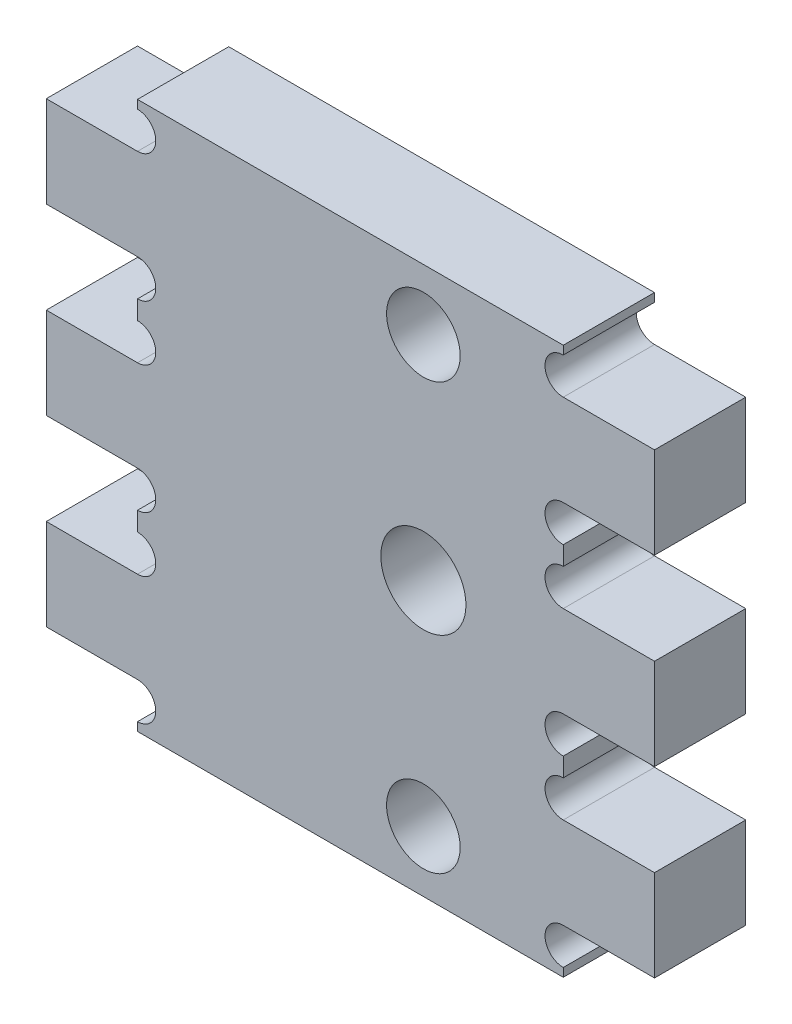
ISO-10303-21;
HEADER;
FILE_DESCRIPTION(('STEP AP214'),'2;1');
FILE_NAME('part.step','',(''),(''),'','','');
FILE_SCHEMA(('AUTOMOTIVE_DESIGN { 1 0 10303 214 1 1 1 1 }'));
ENDSEC;
DATA;
#1=APPLICATION_CONTEXT('core data for automotive mechanical design processes');
#2=APPLICATION_PROTOCOL_DEFINITION('international standard','automotive_design',2000,#1);
#3=PRODUCT_CONTEXT('',#1,'mechanical');
#4=PRODUCT('Part','Part','',(#3));
#5=PRODUCT_RELATED_PRODUCT_CATEGORY('part','',(#4));
#6=PRODUCT_DEFINITION_FORMATION('','',#4);
#7=PRODUCT_DEFINITION_CONTEXT('part definition',#1,'design');
#8=PRODUCT_DEFINITION('design','',#6,#7);
#9=PRODUCT_DEFINITION_SHAPE('','',#8);
#10=(LENGTH_UNIT() NAMED_UNIT(*) SI_UNIT(.MILLI.,.METRE.));
#11=(NAMED_UNIT(*) PLANE_ANGLE_UNIT() SI_UNIT($,.RADIAN.));
#12=(NAMED_UNIT(*) SI_UNIT($,.STERADIAN.) SOLID_ANGLE_UNIT());
#13=UNCERTAINTY_MEASURE_WITH_UNIT(LENGTH_MEASURE(1.E-05),#10,'distance_accuracy_value','');
#14=(GEOMETRIC_REPRESENTATION_CONTEXT(3) GLOBAL_UNCERTAINTY_ASSIGNED_CONTEXT((#13)) GLOBAL_UNIT_ASSIGNED_CONTEXT((#10,
#11,#12)) REPRESENTATION_CONTEXT('',''));
#15=CARTESIAN_POINT('',(0.,0.,0.));
#16=DIRECTION('',(0.,0.,1.));
#17=DIRECTION('',(1.,0.,0.));
#18=AXIS2_PLACEMENT_3D('',#15,#16,#17);
#19=CARTESIAN_POINT('',(96.5881133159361,34.5,15.));
#20=DIRECTION('',(0.,0.,-1.));
#21=DIRECTION('',(-1.,0.,0.));
#22=AXIS2_PLACEMENT_3D('',#19,#20,#21);
#23=CYLINDRICAL_SURFACE('',#22,3.00000000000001);
#24=CARTESIAN_POINT('',(96.5881133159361,34.5,0.));
#25=DIRECTION('',(0.,0.,-1.));
#26=DIRECTION('',(1.,0.,0.));
#27=AXIS2_PLACEMENT_3D('',#24,#25,#26);
#28=CIRCLE('',#27,3.00000000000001);
#29=CARTESIAN_POINT('',(96.5881133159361,31.5,0.));
#30=VERTEX_POINT('',#29);
#31=CARTESIAN_POINT('',(96.5881133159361,37.5,0.));
#32=VERTEX_POINT('',#31);
#33=EDGE_CURVE('E323',#30,#32,#28,.T.);
#34=ORIENTED_EDGE('',*,*,#33,.T.);
#35=DIRECTION('',(0.,0.,-1.));
#36=VECTOR('',#35,1.);
#37=CARTESIAN_POINT('',(96.5881133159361,37.5,15.));
#38=LINE('',#37,#36);
#39=CARTESIAN_POINT('',(96.5881133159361,37.5,15.));
#40=VERTEX_POINT('',#39);
#41=EDGE_CURVE('E11',#40,#32,#38,.T.);
#42=ORIENTED_EDGE('',*,*,#41,.F.);
#43=CARTESIAN_POINT('',(96.5881133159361,34.5,15.));
#44=DIRECTION('',(0.,0.,-1.));
#45=DIRECTION('',(1.,0.,0.));
#46=AXIS2_PLACEMENT_3D('',#43,#44,#45);
#47=CIRCLE('',#46,3.00000000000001);
#48=CARTESIAN_POINT('',(96.5881133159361,31.5,15.));
#49=VERTEX_POINT('',#48);
#50=EDGE_CURVE('E402',#49,#40,#47,.T.);
#51=ORIENTED_EDGE('',*,*,#50,.F.);
#52=DIRECTION('',(0.,0.,-1.));
#53=VECTOR('',#52,1.);
#54=CARTESIAN_POINT('',(96.5881133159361,31.5,15.));
#55=LINE('',#54,#53);
#56=EDGE_CURVE('E319',#49,#30,#55,.T.);
#57=ORIENTED_EDGE('',*,*,#56,.T.);
#58=EDGE_LOOP('',(#34,#42,#51,#57));
#59=FACE_BOUND('',#58,.T.);
#60=ADVANCED_FACE('F35',(#59),#23,.F.);
#61=CARTESIAN_POINT('',(96.5881133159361,37.5,15.));
#62=DIRECTION('',(0.,1.,0.));
#63=DIRECTION('',(-1.,0.,0.));
#64=AXIS2_PLACEMENT_3D('',#61,#62,#63);
#65=PLANE('',#64);
#66=DIRECTION('',(1.,0.,0.));
#67=VECTOR('',#66,1.);
#68=CARTESIAN_POINT('',(96.5881133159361,37.5,0.));
#69=LINE('',#68,#67);
#70=CARTESIAN_POINT('',(111.588113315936,37.5,0.));
#71=VERTEX_POINT('',#70);
#72=EDGE_CURVE('E326',#32,#71,#69,.T.);
#73=ORIENTED_EDGE('',*,*,#72,.T.);
#74=DIRECTION('',(0.,0.,-1.));
#75=VECTOR('',#74,1.);
#76=CARTESIAN_POINT('',(111.588113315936,37.5,15.));
#77=LINE('',#76,#75);
#78=CARTESIAN_POINT('',(111.588113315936,37.5,15.));
#79=VERTEX_POINT('',#78);
#80=EDGE_CURVE('E43',#79,#71,#77,.T.);
#81=ORIENTED_EDGE('',*,*,#80,.F.);
#82=DIRECTION('',(1.,0.,0.));
#83=VECTOR('',#82,1.);
#84=CARTESIAN_POINT('',(96.5881133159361,37.5,15.));
#85=LINE('',#84,#83);
#86=EDGE_CURVE('E190',#40,#79,#85,.T.);
#87=ORIENTED_EDGE('',*,*,#86,.F.);
#88=ORIENTED_EDGE('',*,*,#41,.T.);
#89=EDGE_LOOP('',(#73,#81,#87,#88));
#90=FACE_BOUND('',#89,.T.);
#91=ADVANCED_FACE('F621',(#90),#65,.F.);
#92=CARTESIAN_POINT('',(111.588113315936,37.5,15.));
#93=DIRECTION('',(-1.,0.,0.));
#94=DIRECTION('',(0.,0.,1.));
#95=AXIS2_PLACEMENT_3D('',#92,#93,#94);
#96=PLANE('',#95);
#97=DIRECTION('',(0.,1.,0.));
#98=VECTOR('',#97,1.);
#99=CARTESIAN_POINT('',(111.588113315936,37.5,0.));
#100=LINE('',#99,#98);
#101=CARTESIAN_POINT('',(111.588113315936,52.5,0.));
#102=VERTEX_POINT('',#101);
#103=EDGE_CURVE('E329',#71,#102,#100,.T.);
#104=ORIENTED_EDGE('',*,*,#103,.T.);
#105=DIRECTION('',(0.,0.,-1.));
#106=VECTOR('',#105,1.);
#107=CARTESIAN_POINT('',(111.588113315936,52.5,15.));
#108=LINE('',#107,#106);
#109=CARTESIAN_POINT('',(111.588113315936,52.5,15.));
#110=VERTEX_POINT('',#109);
#111=EDGE_CURVE('E505',#110,#102,#108,.T.);
#112=ORIENTED_EDGE('',*,*,#111,.F.);
#113=DIRECTION('',(0.,1.,0.));
#114=VECTOR('',#113,1.);
#115=CARTESIAN_POINT('',(111.588113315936,37.5,15.));
#116=LINE('',#115,#114);
#117=EDGE_CURVE('E513',#79,#110,#116,.T.);
#118=ORIENTED_EDGE('',*,*,#117,.F.);
#119=ORIENTED_EDGE('',*,*,#80,.T.);
#120=EDGE_LOOP('',(#104,#112,#118,#119));
#121=FACE_BOUND('',#120,.T.);
#122=ADVANCED_FACE('F511',(#121),#96,.F.);
#123=CARTESIAN_POINT('',(111.588113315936,52.5,15.));
#124=DIRECTION('',(0.,-1.,0.));
#125=DIRECTION('',(1.,0.,0.));
#126=AXIS2_PLACEMENT_3D('',#123,#124,#125);
#127=PLANE('',#126);
#128=DIRECTION('',(-1.,0.,0.));
#129=VECTOR('',#128,1.);
#130=CARTESIAN_POINT('',(111.588113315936,52.5,0.));
#131=LINE('',#130,#129);
#132=CARTESIAN_POINT('',(96.5881133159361,52.5,0.));
#133=VERTEX_POINT('',#132);
#134=EDGE_CURVE('E331',#102,#133,#131,.T.);
#135=ORIENTED_EDGE('',*,*,#134,.T.);
#136=DIRECTION('',(0.,0.,-1.));
#137=VECTOR('',#136,1.);
#138=CARTESIAN_POINT('',(96.5881133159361,52.5,15.));
#139=LINE('',#138,#137);
#140=CARTESIAN_POINT('',(96.5881133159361,52.5,15.));
#141=VERTEX_POINT('',#140);
#142=EDGE_CURVE('E502',#141,#133,#139,.T.);
#143=ORIENTED_EDGE('',*,*,#142,.F.);
#144=DIRECTION('',(-1.,0.,0.));
#145=VECTOR('',#144,1.);
#146=CARTESIAN_POINT('',(111.588113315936,52.5,15.));
#147=LINE('',#146,#145);
#148=EDGE_CURVE('E531',#110,#141,#147,.T.);
#149=ORIENTED_EDGE('',*,*,#148,.F.);
#150=ORIENTED_EDGE('',*,*,#111,.T.);
#151=EDGE_LOOP('',(#135,#143,#149,#150));
#152=FACE_BOUND('',#151,.T.);
#153=ADVANCED_FACE('F522',(#152),#127,.F.);
#154=CARTESIAN_POINT('',(96.5881133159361,55.5,15.));
#155=DIRECTION('',(0.,0.,-1.));
#156=DIRECTION('',(-1.,0.,0.));
#157=AXIS2_PLACEMENT_3D('',#154,#155,#156);
#158=CYLINDRICAL_SURFACE('',#157,3.);
#159=CARTESIAN_POINT('',(96.5881133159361,55.5,0.));
#160=DIRECTION('',(0.,0.,-1.));
#161=DIRECTION('',(1.,0.,0.));
#162=AXIS2_PLACEMENT_3D('',#159,#160,#161);
#163=CIRCLE('',#162,3.);
#164=CARTESIAN_POINT('',(96.5881133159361,58.5,0.));
#165=VERTEX_POINT('',#164);
#166=EDGE_CURVE('E333',#133,#165,#163,.T.);
#167=ORIENTED_EDGE('',*,*,#166,.T.);
#168=DIRECTION('',(0.,0.,-1.));
#169=VECTOR('',#168,1.);
#170=CARTESIAN_POINT('',(96.5881133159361,58.5,15.));
#171=LINE('',#170,#169);
#172=CARTESIAN_POINT('',(96.5881133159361,58.5,15.));
#173=VERTEX_POINT('',#172);
#174=EDGE_CURVE('E499',#173,#165,#171,.T.);
#175=ORIENTED_EDGE('',*,*,#174,.F.);
#176=CARTESIAN_POINT('',(96.5881133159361,55.5,15.));
#177=DIRECTION('',(0.,0.,-1.));
#178=DIRECTION('',(1.,0.,0.));
#179=AXIS2_PLACEMENT_3D('',#176,#177,#178);
#180=CIRCLE('',#179,3.);
#181=EDGE_CURVE('E528',#141,#173,#180,.T.);
#182=ORIENTED_EDGE('',*,*,#181,.F.);
#183=ORIENTED_EDGE('',*,*,#142,.T.);
#184=EDGE_LOOP('',(#167,#175,#182,#183));
#185=FACE_BOUND('',#184,.T.);
#186=ADVANCED_FACE('F526',(#185),#158,.F.);
#187=CARTESIAN_POINT('',(96.5881133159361,61.6,15.));
#188=DIRECTION('',(-1.,0.,0.));
#189=DIRECTION('',(0.,-1.,0.));
#190=AXIS2_PLACEMENT_3D('',#187,#188,#189);
#191=PLANE('',#190);
#192=DIRECTION('',(0.,1.,0.));
#193=VECTOR('',#192,1.);
#194=CARTESIAN_POINT('',(96.5881133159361,61.6,0.));
#195=LINE('',#194,#193);
#196=CARTESIAN_POINT('',(96.5881133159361,61.6,0.));
#197=VERTEX_POINT('',#196);
#198=EDGE_CURVE('E335',#165,#197,#195,.T.);
#199=ORIENTED_EDGE('',*,*,#198,.T.);
#200=DIRECTION('',(0.,0.,-1.));
#201=VECTOR('',#200,1.);
#202=CARTESIAN_POINT('',(96.5881133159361,61.6,15.));
#203=LINE('',#202,#201);
#204=CARTESIAN_POINT('',(96.5881133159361,61.6,15.));
#205=VERTEX_POINT('',#204);
#206=EDGE_CURVE('E496',#205,#197,#203,.T.);
#207=ORIENTED_EDGE('',*,*,#206,.F.);
#208=DIRECTION('',(0.,1.,0.));
#209=VECTOR('',#208,1.);
#210=CARTESIAN_POINT('',(96.5881133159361,61.6,15.));
#211=LINE('',#210,#209);
#212=EDGE_CURVE('E530',#173,#205,#211,.T.);
#213=ORIENTED_EDGE('',*,*,#212,.F.);
#214=ORIENTED_EDGE('',*,*,#174,.T.);
#215=EDGE_LOOP('',(#199,#207,#213,#214));
#216=FACE_BOUND('',#215,.T.);
#217=ADVANCED_FACE('F634',(#216),#191,.F.);
#218=CARTESIAN_POINT('',(96.5881133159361,64.6,15.));
#219=DIRECTION('',(0.,0.,-1.));
#220=DIRECTION('',(-1.,0.,0.));
#221=AXIS2_PLACEMENT_3D('',#218,#219,#220);
#222=CYLINDRICAL_SURFACE('',#221,3.00000000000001);
#223=CARTESIAN_POINT('',(96.5881133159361,64.6,0.));
#224=DIRECTION('',(0.,0.,-1.));
#225=DIRECTION('',(1.,0.,0.));
#226=AXIS2_PLACEMENT_3D('',#223,#224,#225);
#227=CIRCLE('',#226,3.00000000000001);
#228=CARTESIAN_POINT('',(96.5881133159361,67.6,0.));
#229=VERTEX_POINT('',#228);
#230=EDGE_CURVE('E337',#197,#229,#227,.T.);
#231=ORIENTED_EDGE('',*,*,#230,.T.);
#232=DIRECTION('',(0.,0.,-1.));
#233=VECTOR('',#232,1.);
#234=CARTESIAN_POINT('',(96.5881133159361,67.6,15.));
#235=LINE('',#234,#233);
#236=CARTESIAN_POINT('',(96.5881133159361,67.6,15.));
#237=VERTEX_POINT('',#236);
#238=EDGE_CURVE('E493',#237,#229,#235,.T.);
#239=ORIENTED_EDGE('',*,*,#238,.F.);
#240=CARTESIAN_POINT('',(96.5881133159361,64.6,15.));
#241=DIRECTION('',(0.,0.,-1.));
#242=DIRECTION('',(1.,0.,0.));
#243=AXIS2_PLACEMENT_3D('',#240,#241,#242);
#244=CIRCLE('',#243,3.00000000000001);
#245=EDGE_CURVE('E533',#205,#237,#244,.T.);
#246=ORIENTED_EDGE('',*,*,#245,.F.);
#247=ORIENTED_EDGE('',*,*,#206,.T.);
#248=EDGE_LOOP('',(#231,#239,#246,#247));
#249=FACE_BOUND('',#248,.T.);
#250=ADVANCED_FACE('F637',(#249),#222,.F.);
#251=CARTESIAN_POINT('',(96.5881133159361,67.6,15.));
#252=DIRECTION('',(0.,1.,0.));
#253=DIRECTION('',(-1.,0.,0.));
#254=AXIS2_PLACEMENT_3D('',#251,#252,#253);
#255=PLANE('',#254);
#256=DIRECTION('',(1.,0.,0.));
#257=VECTOR('',#256,1.);
#258=CARTESIAN_POINT('',(96.5881133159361,67.6,0.));
#259=LINE('',#258,#257);
#260=CARTESIAN_POINT('',(111.588113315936,67.6,0.));
#261=VERTEX_POINT('',#260);
#262=EDGE_CURVE('E339',#229,#261,#259,.T.);
#263=ORIENTED_EDGE('',*,*,#262,.T.);
#264=DIRECTION('',(0.,0.,-1.));
#265=VECTOR('',#264,1.);
#266=CARTESIAN_POINT('',(111.588113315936,67.6,15.));
#267=LINE('',#266,#265);
#268=CARTESIAN_POINT('',(111.588113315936,67.6,15.));
#269=VERTEX_POINT('',#268);
#270=EDGE_CURVE('E490',#269,#261,#267,.T.);
#271=ORIENTED_EDGE('',*,*,#270,.F.);
#272=DIRECTION('',(1.,0.,0.));
#273=VECTOR('',#272,1.);
#274=CARTESIAN_POINT('',(96.5881133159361,67.6,15.));
#275=LINE('',#274,#273);
#276=EDGE_CURVE('E539',#237,#269,#275,.T.);
#277=ORIENTED_EDGE('',*,*,#276,.F.);
#278=ORIENTED_EDGE('',*,*,#238,.T.);
#279=EDGE_LOOP('',(#263,#271,#277,#278));
#280=FACE_BOUND('',#279,.T.);
#281=ADVANCED_FACE('F641',(#280),#255,.F.);
#282=CARTESIAN_POINT('',(111.588113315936,67.6,15.));
#283=DIRECTION('',(-1.,0.,0.));
#284=DIRECTION('',(0.,0.,1.));
#285=AXIS2_PLACEMENT_3D('',#282,#283,#284);
#286=PLANE('',#285);
#287=DIRECTION('',(0.,1.,0.));
#288=VECTOR('',#287,1.);
#289=CARTESIAN_POINT('',(111.588113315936,67.6,0.));
#290=LINE('',#289,#288);
#291=CARTESIAN_POINT('',(111.588113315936,82.6,0.));
#292=VERTEX_POINT('',#291);
#293=EDGE_CURVE('E341',#261,#292,#290,.T.);
#294=ORIENTED_EDGE('',*,*,#293,.T.);
#295=DIRECTION('',(0.,0.,-1.));
#296=VECTOR('',#295,1.);
#297=CARTESIAN_POINT('',(111.588113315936,82.6,15.));
#298=LINE('',#297,#296);
#299=CARTESIAN_POINT('',(111.588113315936,82.6,15.));
#300=VERTEX_POINT('',#299);
#301=EDGE_CURVE('E487',#300,#292,#298,.T.);
#302=ORIENTED_EDGE('',*,*,#301,.F.);
#303=DIRECTION('',(0.,1.,0.));
#304=VECTOR('',#303,1.);
#305=CARTESIAN_POINT('',(111.588113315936,67.6,15.));
#306=LINE('',#305,#304);
#307=EDGE_CURVE('E541',#269,#300,#306,.T.);
#308=ORIENTED_EDGE('',*,*,#307,.F.);
#309=ORIENTED_EDGE('',*,*,#270,.T.);
#310=EDGE_LOOP('',(#294,#302,#308,#309));
#311=FACE_BOUND('',#310,.T.);
#312=ADVANCED_FACE('F645',(#311),#286,.F.);
#313=CARTESIAN_POINT('',(111.588113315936,82.6,15.));
#314=DIRECTION('',(0.,-1.,0.));
#315=DIRECTION('',(1.,0.,0.));
#316=AXIS2_PLACEMENT_3D('',#313,#314,#315);
#317=PLANE('',#316);
#318=DIRECTION('',(-1.,0.,0.));
#319=VECTOR('',#318,1.);
#320=CARTESIAN_POINT('',(111.588113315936,82.6,0.));
#321=LINE('',#320,#319);
#322=CARTESIAN_POINT('',(96.5881133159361,82.6,0.));
#323=VERTEX_POINT('',#322);
#324=EDGE_CURVE('E343',#292,#323,#321,.T.);
#325=ORIENTED_EDGE('',*,*,#324,.T.);
#326=DIRECTION('',(0.,0.,-1.));
#327=VECTOR('',#326,1.);
#328=CARTESIAN_POINT('',(96.5881133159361,82.6,15.));
#329=LINE('',#328,#327);
#330=CARTESIAN_POINT('',(96.5881133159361,82.6,15.));
#331=VERTEX_POINT('',#330);
#332=EDGE_CURVE('E484',#331,#323,#329,.T.);
#333=ORIENTED_EDGE('',*,*,#332,.F.);
#334=DIRECTION('',(-1.,0.,0.));
#335=VECTOR('',#334,1.);
#336=CARTESIAN_POINT('',(111.588113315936,82.6,15.));
#337=LINE('',#336,#335);
#338=EDGE_CURVE('E543',#300,#331,#337,.T.);
#339=ORIENTED_EDGE('',*,*,#338,.F.);
#340=ORIENTED_EDGE('',*,*,#301,.T.);
#341=EDGE_LOOP('',(#325,#333,#339,#340));
#342=FACE_BOUND('',#341,.T.);
#343=ADVANCED_FACE('F649',(#342),#317,.F.);
#344=CARTESIAN_POINT('',(96.5881133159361,85.6,15.));
#345=DIRECTION('',(0.,0.,-1.));
#346=DIRECTION('',(-1.,0.,0.));
#347=AXIS2_PLACEMENT_3D('',#344,#345,#346);
#348=CYLINDRICAL_SURFACE('',#347,3.);
#349=CARTESIAN_POINT('',(96.5881133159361,85.6,0.));
#350=DIRECTION('',(0.,0.,-1.));
#351=DIRECTION('',(1.,0.,0.));
#352=AXIS2_PLACEMENT_3D('',#349,#350,#351);
#353=CIRCLE('',#352,3.);
#354=CARTESIAN_POINT('',(96.5881133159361,88.6,0.));
#355=VERTEX_POINT('',#354);
#356=EDGE_CURVE('E345',#323,#355,#353,.T.);
#357=ORIENTED_EDGE('',*,*,#356,.T.);
#358=DIRECTION('',(0.,0.,-1.));
#359=VECTOR('',#358,1.);
#360=CARTESIAN_POINT('',(96.5881133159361,88.6,15.));
#361=LINE('',#360,#359);
#362=CARTESIAN_POINT('',(96.5881133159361,88.6,15.));
#363=VERTEX_POINT('',#362);
#364=EDGE_CURVE('E481',#363,#355,#361,.T.);
#365=ORIENTED_EDGE('',*,*,#364,.F.);
#366=CARTESIAN_POINT('',(96.5881133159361,85.6,15.));
#367=DIRECTION('',(0.,0.,-1.));
#368=DIRECTION('',(1.,0.,0.));
#369=AXIS2_PLACEMENT_3D('',#366,#367,#368);
#370=CIRCLE('',#369,3.);
#371=EDGE_CURVE('E545',#331,#363,#370,.T.);
#372=ORIENTED_EDGE('',*,*,#371,.F.);
#373=ORIENTED_EDGE('',*,*,#332,.T.);
#374=EDGE_LOOP('',(#357,#365,#372,#373));
#375=FACE_BOUND('',#374,.T.);
#376=ADVANCED_FACE('F653',(#375),#348,.F.);
#377=CARTESIAN_POINT('',(96.5881133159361,90.,15.));
#378=DIRECTION('',(-1.,0.,0.));
#379=DIRECTION('',(0.,-1.,0.));
#380=AXIS2_PLACEMENT_3D('',#377,#378,#379);
#381=PLANE('',#380);
#382=DIRECTION('',(0.,1.,0.));
#383=VECTOR('',#382,1.);
#384=CARTESIAN_POINT('',(96.5881133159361,90.,0.));
#385=LINE('',#384,#383);
#386=CARTESIAN_POINT('',(96.5881133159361,90.,0.));
#387=VERTEX_POINT('',#386);
#388=EDGE_CURVE('E347',#355,#387,#385,.T.);
#389=ORIENTED_EDGE('',*,*,#388,.T.);
#390=DIRECTION('',(0.,0.,-1.));
#391=VECTOR('',#390,1.);
#392=CARTESIAN_POINT('',(96.5881133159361,90.,15.));
#393=LINE('',#392,#391);
#394=CARTESIAN_POINT('',(96.5881133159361,90.,15.));
#395=VERTEX_POINT('',#394);
#396=EDGE_CURVE('E478',#395,#387,#393,.T.);
#397=ORIENTED_EDGE('',*,*,#396,.F.);
#398=DIRECTION('',(0.,1.,0.));
#399=VECTOR('',#398,1.);
#400=CARTESIAN_POINT('',(96.5881133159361,90.,15.));
#401=LINE('',#400,#399);
#402=EDGE_CURVE('E547',#363,#395,#401,.T.);
#403=ORIENTED_EDGE('',*,*,#402,.F.);
#404=ORIENTED_EDGE('',*,*,#364,.T.);
#405=EDGE_LOOP('',(#389,#397,#403,#404));
#406=FACE_BOUND('',#405,.T.);
#407=ADVANCED_FACE('F657',(#406),#381,.F.);
#408=CARTESIAN_POINT('',(26.5881133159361,90.,15.));
#409=DIRECTION('',(0.,-1.,0.));
#410=DIRECTION('',(1.,0.,0.));
#411=AXIS2_PLACEMENT_3D('',#408,#409,#410);
#412=PLANE('',#411);
#413=DIRECTION('',(-1.,0.,0.));
#414=VECTOR('',#413,1.);
#415=CARTESIAN_POINT('',(26.5881133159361,90.,0.));
#416=LINE('',#415,#414);
#417=CARTESIAN_POINT('',(26.5881133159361,90.,0.));
#418=VERTEX_POINT('',#417);
#419=EDGE_CURVE('E349',#387,#418,#416,.T.);
#420=ORIENTED_EDGE('',*,*,#419,.T.);
#421=DIRECTION('',(0.,0.,-1.));
#422=VECTOR('',#421,1.);
#423=CARTESIAN_POINT('',(26.5881133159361,90.,15.));
#424=LINE('',#423,#422);
#425=CARTESIAN_POINT('',(26.5881133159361,90.,15.));
#426=VERTEX_POINT('',#425);
#427=EDGE_CURVE('E475',#426,#418,#424,.T.);
#428=ORIENTED_EDGE('',*,*,#427,.F.);
#429=DIRECTION('',(-1.,0.,0.));
#430=VECTOR('',#429,1.);
#431=CARTESIAN_POINT('',(26.5881133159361,90.,15.));
#432=LINE('',#431,#430);
#433=EDGE_CURVE('E549',#395,#426,#432,.T.);
#434=ORIENTED_EDGE('',*,*,#433,.F.);
#435=ORIENTED_EDGE('',*,*,#396,.T.);
#436=EDGE_LOOP('',(#420,#428,#434,#435));
#437=FACE_BOUND('',#436,.T.);
#438=ADVANCED_FACE('F661',(#437),#412,.F.);
#439=CARTESIAN_POINT('',(26.5881133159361,90.,15.));
#440=DIRECTION('',(1.,0.,0.));
#441=DIRECTION('',(0.,0.,-1.));
#442=AXIS2_PLACEMENT_3D('',#439,#440,#441);
#443=PLANE('',#442);
#444=DIRECTION('',(0.,-1.,0.));
#445=VECTOR('',#444,1.);
#446=CARTESIAN_POINT('',(26.5881133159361,90.,0.));
#447=LINE('',#446,#445);
#448=CARTESIAN_POINT('',(26.5881133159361,88.6,0.));
#449=VERTEX_POINT('',#448);
#450=EDGE_CURVE('E351',#418,#449,#447,.T.);
#451=ORIENTED_EDGE('',*,*,#450,.T.);
#452=DIRECTION('',(0.,0.,-1.));
#453=VECTOR('',#452,1.);
#454=CARTESIAN_POINT('',(26.5881133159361,88.6,15.));
#455=LINE('',#454,#453);
#456=CARTESIAN_POINT('',(26.5881133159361,88.6,15.));
#457=VERTEX_POINT('',#456);
#458=EDGE_CURVE('E472',#457,#449,#455,.T.);
#459=ORIENTED_EDGE('',*,*,#458,.F.);
#460=DIRECTION('',(0.,-1.,0.));
#461=VECTOR('',#460,1.);
#462=CARTESIAN_POINT('',(26.5881133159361,90.,15.));
#463=LINE('',#462,#461);
#464=EDGE_CURVE('E551',#426,#457,#463,.T.);
#465=ORIENTED_EDGE('',*,*,#464,.F.);
#466=ORIENTED_EDGE('',*,*,#427,.T.);
#467=EDGE_LOOP('',(#451,#459,#465,#466));
#468=FACE_BOUND('',#467,.T.);
#469=ADVANCED_FACE('F665',(#468),#443,.F.);
#470=CARTESIAN_POINT('',(26.5881133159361,85.6,15.));
#471=DIRECTION('',(0.,0.,-1.));
#472=DIRECTION('',(-1.,0.,0.));
#473=AXIS2_PLACEMENT_3D('',#470,#471,#472);
#474=CYLINDRICAL_SURFACE('',#473,3.);
#475=CARTESIAN_POINT('',(26.5881133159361,85.6,0.));
#476=DIRECTION('',(0.,0.,-1.));
#477=DIRECTION('',(-1.,0.,0.));
#478=AXIS2_PLACEMENT_3D('',#475,#476,#477);
#479=CIRCLE('',#478,3.);
#480=CARTESIAN_POINT('',(26.5881133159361,82.6,0.));
#481=VERTEX_POINT('',#480);
#482=EDGE_CURVE('E353',#449,#481,#479,.T.);
#483=ORIENTED_EDGE('',*,*,#482,.T.);
#484=DIRECTION('',(0.,0.,-1.));
#485=VECTOR('',#484,1.);
#486=CARTESIAN_POINT('',(26.5881133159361,82.6,15.));
#487=LINE('',#486,#485);
#488=CARTESIAN_POINT('',(26.5881133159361,82.6,15.));
#489=VERTEX_POINT('',#488);
#490=EDGE_CURVE('E469',#489,#481,#487,.T.);
#491=ORIENTED_EDGE('',*,*,#490,.F.);
#492=CARTESIAN_POINT('',(26.5881133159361,85.6,15.));
#493=DIRECTION('',(0.,0.,-1.));
#494=DIRECTION('',(-1.,0.,0.));
#495=AXIS2_PLACEMENT_3D('',#492,#493,#494);
#496=CIRCLE('',#495,3.);
#497=EDGE_CURVE('E553',#457,#489,#496,.T.);
#498=ORIENTED_EDGE('',*,*,#497,.F.);
#499=ORIENTED_EDGE('',*,*,#458,.T.);
#500=EDGE_LOOP('',(#483,#491,#498,#499));
#501=FACE_BOUND('',#500,.T.);
#502=ADVANCED_FACE('F669',(#501),#474,.F.);
#503=CARTESIAN_POINT('',(11.5881133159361,82.6,15.));
#504=DIRECTION('',(0.,-1.,0.));
#505=DIRECTION('',(0.,0.,-1.));
#506=AXIS2_PLACEMENT_3D('',#503,#504,#505);
#507=PLANE('',#506);
#508=DIRECTION('',(-1.,0.,0.));
#509=VECTOR('',#508,1.);
#510=CARTESIAN_POINT('',(11.5881133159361,82.6,0.));
#511=LINE('',#510,#509);
#512=CARTESIAN_POINT('',(11.5881133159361,82.6,0.));
#513=VERTEX_POINT('',#512);
#514=EDGE_CURVE('E355',#481,#513,#511,.T.);
#515=ORIENTED_EDGE('',*,*,#514,.T.);
#516=DIRECTION('',(0.,0.,-1.));
#517=VECTOR('',#516,1.);
#518=CARTESIAN_POINT('',(11.5881133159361,82.6,15.));
#519=LINE('',#518,#517);
#520=CARTESIAN_POINT('',(11.5881133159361,82.6,15.));
#521=VERTEX_POINT('',#520);
#522=EDGE_CURVE('E466',#521,#513,#519,.T.);
#523=ORIENTED_EDGE('',*,*,#522,.F.);
#524=DIRECTION('',(-1.,0.,0.));
#525=VECTOR('',#524,1.);
#526=CARTESIAN_POINT('',(11.5881133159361,82.6,15.));
#527=LINE('',#526,#525);
#528=EDGE_CURVE('E555',#489,#521,#527,.T.);
#529=ORIENTED_EDGE('',*,*,#528,.F.);
#530=ORIENTED_EDGE('',*,*,#490,.T.);
#531=EDGE_LOOP('',(#515,#523,#529,#530));
#532=FACE_BOUND('',#531,.T.);
#533=ADVANCED_FACE('F673',(#532),#507,.F.);
#534=CARTESIAN_POINT('',(11.5881133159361,67.6,15.));
#535=DIRECTION('',(1.,0.,0.));
#536=DIRECTION('',(0.,0.,-1.));
#537=AXIS2_PLACEMENT_3D('',#534,#535,#536);
#538=PLANE('',#537);
#539=DIRECTION('',(0.,-1.,0.));
#540=VECTOR('',#539,1.);
#541=CARTESIAN_POINT('',(11.5881133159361,67.6,0.));
#542=LINE('',#541,#540);
#543=CARTESIAN_POINT('',(11.5881133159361,67.6,0.));
#544=VERTEX_POINT('',#543);
#545=EDGE_CURVE('E357',#513,#544,#542,.T.);
#546=ORIENTED_EDGE('',*,*,#545,.T.);
#547=DIRECTION('',(0.,0.,-1.));
#548=VECTOR('',#547,1.);
#549=CARTESIAN_POINT('',(11.5881133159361,67.6,15.));
#550=LINE('',#549,#548);
#551=CARTESIAN_POINT('',(11.5881133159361,67.6,15.));
#552=VERTEX_POINT('',#551);
#553=EDGE_CURVE('E463',#552,#544,#550,.T.);
#554=ORIENTED_EDGE('',*,*,#553,.F.);
#555=DIRECTION('',(0.,-1.,0.));
#556=VECTOR('',#555,1.);
#557=CARTESIAN_POINT('',(11.5881133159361,67.6,15.));
#558=LINE('',#557,#556);
#559=EDGE_CURVE('E557',#521,#552,#558,.T.);
#560=ORIENTED_EDGE('',*,*,#559,.F.);
#561=ORIENTED_EDGE('',*,*,#522,.T.);
#562=EDGE_LOOP('',(#546,#554,#560,#561));
#563=FACE_BOUND('',#562,.T.);
#564=ADVANCED_FACE('F677',(#563),#538,.F.);
#565=CARTESIAN_POINT('',(26.5881133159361,67.6,15.));
#566=DIRECTION('',(0.,1.,0.));
#567=DIRECTION('',(0.,0.,1.));
#568=AXIS2_PLACEMENT_3D('',#565,#566,#567);
#569=PLANE('',#568);
#570=DIRECTION('',(1.,0.,0.));
#571=VECTOR('',#570,1.);
#572=CARTESIAN_POINT('',(26.5881133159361,67.6,0.));
#573=LINE('',#572,#571);
#574=CARTESIAN_POINT('',(26.5881133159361,67.6,0.));
#575=VERTEX_POINT('',#574);
#576=EDGE_CURVE('E359',#544,#575,#573,.T.);
#577=ORIENTED_EDGE('',*,*,#576,.T.);
#578=DIRECTION('',(0.,0.,-1.));
#579=VECTOR('',#578,1.);
#580=CARTESIAN_POINT('',(26.5881133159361,67.6,15.));
#581=LINE('',#580,#579);
#582=CARTESIAN_POINT('',(26.5881133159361,67.6,15.));
#583=VERTEX_POINT('',#582);
#584=EDGE_CURVE('E460',#583,#575,#581,.T.);
#585=ORIENTED_EDGE('',*,*,#584,.F.);
#586=DIRECTION('',(1.,0.,0.));
#587=VECTOR('',#586,1.);
#588=CARTESIAN_POINT('',(26.5881133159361,67.6,15.));
#589=LINE('',#588,#587);
#590=EDGE_CURVE('E559',#552,#583,#589,.T.);
#591=ORIENTED_EDGE('',*,*,#590,.F.);
#592=ORIENTED_EDGE('',*,*,#553,.T.);
#593=EDGE_LOOP('',(#577,#585,#591,#592));
#594=FACE_BOUND('',#593,.T.);
#595=ADVANCED_FACE('F681',(#594),#569,.F.);
#596=CARTESIAN_POINT('',(26.5881133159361,64.6,15.));
#597=DIRECTION('',(0.,0.,-1.));
#598=DIRECTION('',(-1.,0.,0.));
#599=AXIS2_PLACEMENT_3D('',#596,#597,#598);
#600=CYLINDRICAL_SURFACE('',#599,3.);
#601=CARTESIAN_POINT('',(26.5881133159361,64.6,0.));
#602=DIRECTION('',(0.,0.,-1.));
#603=DIRECTION('',(-1.,0.,0.));
#604=AXIS2_PLACEMENT_3D('',#601,#602,#603);
#605=CIRCLE('',#604,3.);
#606=CARTESIAN_POINT('',(26.5881133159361,61.6,0.));
#607=VERTEX_POINT('',#606);
#608=EDGE_CURVE('E361',#575,#607,#605,.T.);
#609=ORIENTED_EDGE('',*,*,#608,.T.);
#610=DIRECTION('',(0.,0.,-1.));
#611=VECTOR('',#610,1.);
#612=CARTESIAN_POINT('',(26.5881133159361,61.6,15.));
#613=LINE('',#612,#611);
#614=CARTESIAN_POINT('',(26.5881133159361,61.6,15.));
#615=VERTEX_POINT('',#614);
#616=EDGE_CURVE('E457',#615,#607,#613,.T.);
#617=ORIENTED_EDGE('',*,*,#616,.F.);
#618=CARTESIAN_POINT('',(26.5881133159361,64.6,15.));
#619=DIRECTION('',(0.,0.,-1.));
#620=DIRECTION('',(-1.,0.,0.));
#621=AXIS2_PLACEMENT_3D('',#618,#619,#620);
#622=CIRCLE('',#621,3.);
#623=EDGE_CURVE('E561',#583,#615,#622,.T.);
#624=ORIENTED_EDGE('',*,*,#623,.F.);
#625=ORIENTED_EDGE('',*,*,#584,.T.);
#626=EDGE_LOOP('',(#609,#617,#624,#625));
#627=FACE_BOUND('',#626,.T.);
#628=ADVANCED_FACE('F685',(#627),#600,.F.);
#629=CARTESIAN_POINT('',(26.5881133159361,61.6,15.));
#630=DIRECTION('',(1.,0.,0.));
#631=DIRECTION('',(0.,1.,0.));
#632=AXIS2_PLACEMENT_3D('',#629,#630,#631);
#633=PLANE('',#632);
#634=DIRECTION('',(0.,-1.,0.));
#635=VECTOR('',#634,1.);
#636=CARTESIAN_POINT('',(26.5881133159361,61.6,0.));
#637=LINE('',#636,#635);
#638=CARTESIAN_POINT('',(26.5881133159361,58.5,0.));
#639=VERTEX_POINT('',#638);
#640=EDGE_CURVE('E363',#607,#639,#637,.T.);
#641=ORIENTED_EDGE('',*,*,#640,.T.);
#642=DIRECTION('',(0.,0.,-1.));
#643=VECTOR('',#642,1.);
#644=CARTESIAN_POINT('',(26.5881133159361,58.5,15.));
#645=LINE('',#644,#643);
#646=CARTESIAN_POINT('',(26.5881133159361,58.5,15.));
#647=VERTEX_POINT('',#646);
#648=EDGE_CURVE('E454',#647,#639,#645,.T.);
#649=ORIENTED_EDGE('',*,*,#648,.F.);
#650=DIRECTION('',(0.,-1.,0.));
#651=VECTOR('',#650,1.);
#652=CARTESIAN_POINT('',(26.5881133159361,61.6,15.));
#653=LINE('',#652,#651);
#654=EDGE_CURVE('E563',#615,#647,#653,.T.);
#655=ORIENTED_EDGE('',*,*,#654,.F.);
#656=ORIENTED_EDGE('',*,*,#616,.T.);
#657=EDGE_LOOP('',(#641,#649,#655,#656));
#658=FACE_BOUND('',#657,.T.);
#659=ADVANCED_FACE('F689',(#658),#633,.F.);
#660=CARTESIAN_POINT('',(26.5881133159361,55.5,15.));
#661=DIRECTION('',(0.,0.,-1.));
#662=DIRECTION('',(-1.,0.,0.));
#663=AXIS2_PLACEMENT_3D('',#660,#661,#662);
#664=CYLINDRICAL_SURFACE('',#663,3.);
#665=CARTESIAN_POINT('',(26.5881133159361,55.5,0.));
#666=DIRECTION('',(0.,0.,-1.));
#667=DIRECTION('',(-1.,0.,0.));
#668=AXIS2_PLACEMENT_3D('',#665,#666,#667);
#669=CIRCLE('',#668,3.);
#670=CARTESIAN_POINT('',(26.5881133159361,52.5,0.));
#671=VERTEX_POINT('',#670);
#672=EDGE_CURVE('E365',#639,#671,#669,.T.);
#673=ORIENTED_EDGE('',*,*,#672,.T.);
#674=DIRECTION('',(0.,0.,-1.));
#675=VECTOR('',#674,1.);
#676=CARTESIAN_POINT('',(26.5881133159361,52.5,15.));
#677=LINE('',#676,#675);
#678=CARTESIAN_POINT('',(26.5881133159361,52.5,15.));
#679=VERTEX_POINT('',#678);
#680=EDGE_CURVE('E451',#679,#671,#677,.T.);
#681=ORIENTED_EDGE('',*,*,#680,.F.);
#682=CARTESIAN_POINT('',(26.5881133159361,55.5,15.));
#683=DIRECTION('',(0.,0.,-1.));
#684=DIRECTION('',(-1.,0.,0.));
#685=AXIS2_PLACEMENT_3D('',#682,#683,#684);
#686=CIRCLE('',#685,3.);
#687=EDGE_CURVE('E565',#647,#679,#686,.T.);
#688=ORIENTED_EDGE('',*,*,#687,.F.);
#689=ORIENTED_EDGE('',*,*,#648,.T.);
#690=EDGE_LOOP('',(#673,#681,#688,#689));
#691=FACE_BOUND('',#690,.T.);
#692=ADVANCED_FACE('F693',(#691),#664,.F.);
#693=CARTESIAN_POINT('',(11.5881133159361,52.5,15.));
#694=DIRECTION('',(0.,-1.,0.));
#695=DIRECTION('',(0.,0.,-1.));
#696=AXIS2_PLACEMENT_3D('',#693,#694,#695);
#697=PLANE('',#696);
#698=DIRECTION('',(-1.,0.,0.));
#699=VECTOR('',#698,1.);
#700=CARTESIAN_POINT('',(11.5881133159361,52.5,0.));
#701=LINE('',#700,#699);
#702=CARTESIAN_POINT('',(11.5881133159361,52.5,0.));
#703=VERTEX_POINT('',#702);
#704=EDGE_CURVE('E367',#671,#703,#701,.T.);
#705=ORIENTED_EDGE('',*,*,#704,.T.);
#706=DIRECTION('',(0.,0.,-1.));
#707=VECTOR('',#706,1.);
#708=CARTESIAN_POINT('',(11.5881133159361,52.5,15.));
#709=LINE('',#708,#707);
#710=CARTESIAN_POINT('',(11.5881133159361,52.5,15.));
#711=VERTEX_POINT('',#710);
#712=EDGE_CURVE('E448',#711,#703,#709,.T.);
#713=ORIENTED_EDGE('',*,*,#712,.F.);
#714=DIRECTION('',(-1.,0.,0.));
#715=VECTOR('',#714,1.);
#716=CARTESIAN_POINT('',(11.5881133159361,52.5,15.));
#717=LINE('',#716,#715);
#718=EDGE_CURVE('E567',#679,#711,#717,.T.);
#719=ORIENTED_EDGE('',*,*,#718,.F.);
#720=ORIENTED_EDGE('',*,*,#680,.T.);
#721=EDGE_LOOP('',(#705,#713,#719,#720));
#722=FACE_BOUND('',#721,.T.);
#723=ADVANCED_FACE('F697',(#722),#697,.F.);
#724=CARTESIAN_POINT('',(11.5881133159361,37.5,15.));
#725=DIRECTION('',(1.,0.,0.));
#726=DIRECTION('',(0.,0.,-1.));
#727=AXIS2_PLACEMENT_3D('',#724,#725,#726);
#728=PLANE('',#727);
#729=DIRECTION('',(0.,-1.,0.));
#730=VECTOR('',#729,1.);
#731=CARTESIAN_POINT('',(11.5881133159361,37.5,0.));
#732=LINE('',#731,#730);
#733=CARTESIAN_POINT('',(11.5881133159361,37.5,0.));
#734=VERTEX_POINT('',#733);
#735=EDGE_CURVE('E369',#703,#734,#732,.T.);
#736=ORIENTED_EDGE('',*,*,#735,.T.);
#737=DIRECTION('',(0.,0.,-1.));
#738=VECTOR('',#737,1.);
#739=CARTESIAN_POINT('',(11.5881133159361,37.5,15.));
#740=LINE('',#739,#738);
#741=CARTESIAN_POINT('',(11.5881133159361,37.5,15.));
#742=VERTEX_POINT('',#741);
#743=EDGE_CURVE('E445',#742,#734,#740,.T.);
#744=ORIENTED_EDGE('',*,*,#743,.F.);
#745=DIRECTION('',(0.,-1.,0.));
#746=VECTOR('',#745,1.);
#747=CARTESIAN_POINT('',(11.5881133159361,37.5,15.));
#748=LINE('',#747,#746);
#749=EDGE_CURVE('E569',#711,#742,#748,.T.);
#750=ORIENTED_EDGE('',*,*,#749,.F.);
#751=ORIENTED_EDGE('',*,*,#712,.T.);
#752=EDGE_LOOP('',(#736,#744,#750,#751));
#753=FACE_BOUND('',#752,.T.);
#754=ADVANCED_FACE('F701',(#753),#728,.F.);
#755=CARTESIAN_POINT('',(26.5881133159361,37.5,15.));
#756=DIRECTION('',(0.,1.,0.));
#757=DIRECTION('',(-1.,0.,0.));
#758=AXIS2_PLACEMENT_3D('',#755,#756,#757);
#759=PLANE('',#758);
#760=DIRECTION('',(1.,0.,0.));
#761=VECTOR('',#760,1.);
#762=CARTESIAN_POINT('',(26.5881133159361,37.5,0.));
#763=LINE('',#762,#761);
#764=CARTESIAN_POINT('',(26.5881133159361,37.5,0.));
#765=VERTEX_POINT('',#764);
#766=EDGE_CURVE('E371',#734,#765,#763,.T.);
#767=ORIENTED_EDGE('',*,*,#766,.T.);
#768=DIRECTION('',(0.,0.,-1.));
#769=VECTOR('',#768,1.);
#770=CARTESIAN_POINT('',(26.5881133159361,37.5,15.));
#771=LINE('',#770,#769);
#772=CARTESIAN_POINT('',(26.5881133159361,37.5,15.));
#773=VERTEX_POINT('',#772);
#774=EDGE_CURVE('E442',#773,#765,#771,.T.);
#775=ORIENTED_EDGE('',*,*,#774,.F.);
#776=DIRECTION('',(1.,0.,0.));
#777=VECTOR('',#776,1.);
#778=CARTESIAN_POINT('',(26.5881133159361,37.5,15.));
#779=LINE('',#778,#777);
#780=EDGE_CURVE('E571',#742,#773,#779,.T.);
#781=ORIENTED_EDGE('',*,*,#780,.F.);
#782=ORIENTED_EDGE('',*,*,#743,.T.);
#783=EDGE_LOOP('',(#767,#775,#781,#782));
#784=FACE_BOUND('',#783,.T.);
#785=ADVANCED_FACE('F705',(#784),#759,.F.);
#786=CARTESIAN_POINT('',(26.5881133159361,34.5,15.));
#787=DIRECTION('',(0.,0.,-1.));
#788=DIRECTION('',(-1.,0.,0.));
#789=AXIS2_PLACEMENT_3D('',#786,#787,#788);
#790=CYLINDRICAL_SURFACE('',#789,3.00000000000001);
#791=CARTESIAN_POINT('',(26.5881133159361,34.5,0.));
#792=DIRECTION('',(0.,0.,-1.));
#793=DIRECTION('',(-1.,0.,0.));
#794=AXIS2_PLACEMENT_3D('',#791,#792,#793);
#795=CIRCLE('',#794,3.00000000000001);
#796=CARTESIAN_POINT('',(26.5881133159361,31.5,0.));
#797=VERTEX_POINT('',#796);
#798=EDGE_CURVE('E373',#765,#797,#795,.T.);
#799=ORIENTED_EDGE('',*,*,#798,.T.);
#800=DIRECTION('',(0.,0.,-1.));
#801=VECTOR('',#800,1.);
#802=CARTESIAN_POINT('',(26.5881133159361,31.5,15.));
#803=LINE('',#802,#801);
#804=CARTESIAN_POINT('',(26.5881133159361,31.5,15.));
#805=VERTEX_POINT('',#804);
#806=EDGE_CURVE('E439',#805,#797,#803,.T.);
#807=ORIENTED_EDGE('',*,*,#806,.F.);
#808=CARTESIAN_POINT('',(26.5881133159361,34.5,15.));
#809=DIRECTION('',(0.,0.,-1.));
#810=DIRECTION('',(-1.,0.,0.));
#811=AXIS2_PLACEMENT_3D('',#808,#809,#810);
#812=CIRCLE('',#811,3.00000000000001);
#813=EDGE_CURVE('E573',#773,#805,#812,.T.);
#814=ORIENTED_EDGE('',*,*,#813,.F.);
#815=ORIENTED_EDGE('',*,*,#774,.T.);
#816=EDGE_LOOP('',(#799,#807,#814,#815));
#817=FACE_BOUND('',#816,.T.);
#818=ADVANCED_FACE('F709',(#817),#790,.F.);
#819=CARTESIAN_POINT('',(26.5881133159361,31.5,15.));
#820=DIRECTION('',(1.,0.,0.));
#821=DIRECTION('',(0.,1.,0.));
#822=AXIS2_PLACEMENT_3D('',#819,#820,#821);
#823=PLANE('',#822);
#824=DIRECTION('',(0.,-1.,0.));
#825=VECTOR('',#824,1.);
#826=CARTESIAN_POINT('',(26.5881133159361,31.5,0.));
#827=LINE('',#826,#825);
#828=CARTESIAN_POINT('',(26.5881133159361,28.4,0.));
#829=VERTEX_POINT('',#828);
#830=EDGE_CURVE('E375',#797,#829,#827,.T.);
#831=ORIENTED_EDGE('',*,*,#830,.T.);
#832=DIRECTION('',(0.,0.,-1.));
#833=VECTOR('',#832,1.);
#834=CARTESIAN_POINT('',(26.5881133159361,28.4,15.));
#835=LINE('',#834,#833);
#836=CARTESIAN_POINT('',(26.5881133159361,28.4,15.));
#837=VERTEX_POINT('',#836);
#838=EDGE_CURVE('E436',#837,#829,#835,.T.);
#839=ORIENTED_EDGE('',*,*,#838,.F.);
#840=DIRECTION('',(0.,-1.,0.));
#841=VECTOR('',#840,1.);
#842=CARTESIAN_POINT('',(26.5881133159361,31.5,15.));
#843=LINE('',#842,#841);
#844=EDGE_CURVE('E575',#805,#837,#843,.T.);
#845=ORIENTED_EDGE('',*,*,#844,.F.);
#846=ORIENTED_EDGE('',*,*,#806,.T.);
#847=EDGE_LOOP('',(#831,#839,#845,#846));
#848=FACE_BOUND('',#847,.T.);
#849=ADVANCED_FACE('F713',(#848),#823,.F.);
#850=CARTESIAN_POINT('',(26.5881133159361,25.4,15.));
#851=DIRECTION('',(0.,0.,-1.));
#852=DIRECTION('',(-1.,0.,0.));
#853=AXIS2_PLACEMENT_3D('',#850,#851,#852);
#854=CYLINDRICAL_SURFACE('',#853,3.);
#855=CARTESIAN_POINT('',(26.5881133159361,25.4,0.));
#856=DIRECTION('',(0.,0.,-1.));
#857=DIRECTION('',(-1.,0.,0.));
#858=AXIS2_PLACEMENT_3D('',#855,#856,#857);
#859=CIRCLE('',#858,3.);
#860=CARTESIAN_POINT('',(26.5881133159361,22.4,0.));
#861=VERTEX_POINT('',#860);
#862=EDGE_CURVE('E377',#829,#861,#859,.T.);
#863=ORIENTED_EDGE('',*,*,#862,.T.);
#864=DIRECTION('',(0.,0.,-1.));
#865=VECTOR('',#864,1.);
#866=CARTESIAN_POINT('',(26.5881133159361,22.4,15.));
#867=LINE('',#866,#865);
#868=CARTESIAN_POINT('',(26.5881133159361,22.4,15.));
#869=VERTEX_POINT('',#868);
#870=EDGE_CURVE('E433',#869,#861,#867,.T.);
#871=ORIENTED_EDGE('',*,*,#870,.F.);
#872=CARTESIAN_POINT('',(26.5881133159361,25.4,15.));
#873=DIRECTION('',(0.,0.,-1.));
#874=DIRECTION('',(-1.,0.,0.));
#875=AXIS2_PLACEMENT_3D('',#872,#873,#874);
#876=CIRCLE('',#875,3.);
#877=EDGE_CURVE('E577',#837,#869,#876,.T.);
#878=ORIENTED_EDGE('',*,*,#877,.F.);
#879=ORIENTED_EDGE('',*,*,#838,.T.);
#880=EDGE_LOOP('',(#863,#871,#878,#879));
#881=FACE_BOUND('',#880,.T.);
#882=ADVANCED_FACE('F717',(#881),#854,.F.);
#883=CARTESIAN_POINT('',(11.5881133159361,22.4,15.));
#884=DIRECTION('',(0.,-1.,0.));
#885=DIRECTION('',(0.,0.,-1.));
#886=AXIS2_PLACEMENT_3D('',#883,#884,#885);
#887=PLANE('',#886);
#888=DIRECTION('',(-1.,0.,0.));
#889=VECTOR('',#888,1.);
#890=CARTESIAN_POINT('',(11.5881133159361,22.4,0.));
#891=LINE('',#890,#889);
#892=CARTESIAN_POINT('',(11.5881133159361,22.4,0.));
#893=VERTEX_POINT('',#892);
#894=EDGE_CURVE('E379',#861,#893,#891,.T.);
#895=ORIENTED_EDGE('',*,*,#894,.T.);
#896=DIRECTION('',(0.,0.,-1.));
#897=VECTOR('',#896,1.);
#898=CARTESIAN_POINT('',(11.5881133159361,22.4,15.));
#899=LINE('',#898,#897);
#900=CARTESIAN_POINT('',(11.5881133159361,22.4,15.));
#901=VERTEX_POINT('',#900);
#902=EDGE_CURVE('E430',#901,#893,#899,.T.);
#903=ORIENTED_EDGE('',*,*,#902,.F.);
#904=DIRECTION('',(-1.,0.,0.));
#905=VECTOR('',#904,1.);
#906=CARTESIAN_POINT('',(11.5881133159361,22.4,15.));
#907=LINE('',#906,#905);
#908=EDGE_CURVE('E579',#869,#901,#907,.T.);
#909=ORIENTED_EDGE('',*,*,#908,.F.);
#910=ORIENTED_EDGE('',*,*,#870,.T.);
#911=EDGE_LOOP('',(#895,#903,#909,#910));
#912=FACE_BOUND('',#911,.T.);
#913=ADVANCED_FACE('F721',(#912),#887,.F.);
#914=CARTESIAN_POINT('',(11.5881133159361,7.39999999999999,15.));
#915=DIRECTION('',(1.,0.,0.));
#916=DIRECTION('',(0.,0.,-1.));
#917=AXIS2_PLACEMENT_3D('',#914,#915,#916);
#918=PLANE('',#917);
#919=DIRECTION('',(0.,-1.,0.));
#920=VECTOR('',#919,1.);
#921=CARTESIAN_POINT('',(11.5881133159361,7.39999999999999,0.));
#922=LINE('',#921,#920);
#923=CARTESIAN_POINT('',(11.5881133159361,7.39999999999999,0.));
#924=VERTEX_POINT('',#923);
#925=EDGE_CURVE('E381',#893,#924,#922,.T.);
#926=ORIENTED_EDGE('',*,*,#925,.T.);
#927=DIRECTION('',(0.,0.,-1.));
#928=VECTOR('',#927,1.);
#929=CARTESIAN_POINT('',(11.5881133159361,7.39999999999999,15.));
#930=LINE('',#929,#928);
#931=CARTESIAN_POINT('',(11.5881133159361,7.39999999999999,15.));
#932=VERTEX_POINT('',#931);
#933=EDGE_CURVE('E427',#932,#924,#930,.T.);
#934=ORIENTED_EDGE('',*,*,#933,.F.);
#935=DIRECTION('',(0.,-1.,0.));
#936=VECTOR('',#935,1.);
#937=CARTESIAN_POINT('',(11.5881133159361,7.39999999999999,15.));
#938=LINE('',#937,#936);
#939=EDGE_CURVE('E581',#901,#932,#938,.T.);
#940=ORIENTED_EDGE('',*,*,#939,.F.);
#941=ORIENTED_EDGE('',*,*,#902,.T.);
#942=EDGE_LOOP('',(#926,#934,#940,#941));
#943=FACE_BOUND('',#942,.T.);
#944=ADVANCED_FACE('F725',(#943),#918,.F.);
#945=CARTESIAN_POINT('',(26.5881133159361,7.39999999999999,15.));
#946=DIRECTION('',(0.,1.,0.));
#947=DIRECTION('',(-1.,0.,0.));
#948=AXIS2_PLACEMENT_3D('',#945,#946,#947);
#949=PLANE('',#948);
#950=DIRECTION('',(1.,0.,0.));
#951=VECTOR('',#950,1.);
#952=CARTESIAN_POINT('',(26.5881133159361,7.39999999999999,0.));
#953=LINE('',#952,#951);
#954=CARTESIAN_POINT('',(26.5881133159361,7.39999999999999,0.));
#955=VERTEX_POINT('',#954);
#956=EDGE_CURVE('E383',#924,#955,#953,.T.);
#957=ORIENTED_EDGE('',*,*,#956,.T.);
#958=DIRECTION('',(0.,0.,-1.));
#959=VECTOR('',#958,1.);
#960=CARTESIAN_POINT('',(26.5881133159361,7.39999999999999,15.));
#961=LINE('',#960,#959);
#962=CARTESIAN_POINT('',(26.5881133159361,7.39999999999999,15.));
#963=VERTEX_POINT('',#962);
#964=EDGE_CURVE('E424',#963,#955,#961,.T.);
#965=ORIENTED_EDGE('',*,*,#964,.F.);
#966=DIRECTION('',(1.,0.,0.));
#967=VECTOR('',#966,1.);
#968=CARTESIAN_POINT('',(26.5881133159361,7.39999999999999,15.));
#969=LINE('',#968,#967);
#970=EDGE_CURVE('E583',#932,#963,#969,.T.);
#971=ORIENTED_EDGE('',*,*,#970,.F.);
#972=ORIENTED_EDGE('',*,*,#933,.T.);
#973=EDGE_LOOP('',(#957,#965,#971,#972));
#974=FACE_BOUND('',#973,.T.);
#975=ADVANCED_FACE('F729',(#974),#949,.F.);
#976=CARTESIAN_POINT('',(26.5881133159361,4.39999999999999,15.));
#977=DIRECTION('',(0.,0.,-1.));
#978=DIRECTION('',(-1.,0.,0.));
#979=AXIS2_PLACEMENT_3D('',#976,#977,#978);
#980=CYLINDRICAL_SURFACE('',#979,3.);
#981=CARTESIAN_POINT('',(26.5881133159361,4.39999999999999,0.));
#982=DIRECTION('',(0.,0.,-1.));
#983=DIRECTION('',(-1.,0.,0.));
#984=AXIS2_PLACEMENT_3D('',#981,#982,#983);
#985=CIRCLE('',#984,3.);
#986=CARTESIAN_POINT('',(26.5881133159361,1.39999999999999,0.));
#987=VERTEX_POINT('',#986);
#988=EDGE_CURVE('E385',#955,#987,#985,.T.);
#989=ORIENTED_EDGE('',*,*,#988,.T.);
#990=DIRECTION('',(0.,0.,-1.));
#991=VECTOR('',#990,1.);
#992=CARTESIAN_POINT('',(26.5881133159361,1.39999999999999,15.));
#993=LINE('',#992,#991);
#994=CARTESIAN_POINT('',(26.5881133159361,1.39999999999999,15.));
#995=VERTEX_POINT('',#994);
#996=EDGE_CURVE('E421',#995,#987,#993,.T.);
#997=ORIENTED_EDGE('',*,*,#996,.F.);
#998=CARTESIAN_POINT('',(26.5881133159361,4.39999999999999,15.));
#999=DIRECTION('',(0.,0.,-1.));
#1000=DIRECTION('',(-1.,0.,0.));
#1001=AXIS2_PLACEMENT_3D('',#998,#999,#1000);
#1002=CIRCLE('',#1001,3.);
#1003=EDGE_CURVE('E585',#963,#995,#1002,.T.);
#1004=ORIENTED_EDGE('',*,*,#1003,.F.);
#1005=ORIENTED_EDGE('',*,*,#964,.T.);
#1006=EDGE_LOOP('',(#989,#997,#1004,#1005));
#1007=FACE_BOUND('',#1006,.T.);
#1008=ADVANCED_FACE('F733',(#1007),#980,.F.);
#1009=CARTESIAN_POINT('',(26.5881133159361,0.,15.));
#1010=DIRECTION('',(1.,0.,0.));
#1011=DIRECTION('',(0.,1.,0.));
#1012=AXIS2_PLACEMENT_3D('',#1009,#1010,#1011);
#1013=PLANE('',#1012);
#1014=DIRECTION('',(0.,-1.,0.));
#1015=VECTOR('',#1014,1.);
#1016=CARTESIAN_POINT('',(26.5881133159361,0.,0.));
#1017=LINE('',#1016,#1015);
#1018=CARTESIAN_POINT('',(26.5881133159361,0.,0.));
#1019=VERTEX_POINT('',#1018);
#1020=EDGE_CURVE('E387',#987,#1019,#1017,.T.);
#1021=ORIENTED_EDGE('',*,*,#1020,.T.);
#1022=DIRECTION('',(0.,0.,-1.));
#1023=VECTOR('',#1022,1.);
#1024=CARTESIAN_POINT('',(26.5881133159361,0.,15.));
#1025=LINE('',#1024,#1023);
#1026=CARTESIAN_POINT('',(26.5881133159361,0.,15.));
#1027=VERTEX_POINT('',#1026);
#1028=EDGE_CURVE('E418',#1027,#1019,#1025,.T.);
#1029=ORIENTED_EDGE('',*,*,#1028,.F.);
#1030=DIRECTION('',(0.,-1.,0.));
#1031=VECTOR('',#1030,1.);
#1032=CARTESIAN_POINT('',(26.5881133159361,0.,15.));
#1033=LINE('',#1032,#1031);
#1034=EDGE_CURVE('E587',#995,#1027,#1033,.T.);
#1035=ORIENTED_EDGE('',*,*,#1034,.F.);
#1036=ORIENTED_EDGE('',*,*,#996,.T.);
#1037=EDGE_LOOP('',(#1021,#1029,#1035,#1036));
#1038=FACE_BOUND('',#1037,.T.);
#1039=ADVANCED_FACE('F737',(#1038),#1013,.F.);
#1040=CARTESIAN_POINT('',(96.5881133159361,0.,15.));
#1041=DIRECTION('',(0.,1.,0.));
#1042=DIRECTION('',(-1.,0.,0.));
#1043=AXIS2_PLACEMENT_3D('',#1040,#1041,#1042);
#1044=PLANE('',#1043);
#1045=DIRECTION('',(1.,0.,0.));
#1046=VECTOR('',#1045,1.);
#1047=CARTESIAN_POINT('',(96.5881133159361,0.,0.));
#1048=LINE('',#1047,#1046);
#1049=CARTESIAN_POINT('',(96.5881133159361,0.,0.));
#1050=VERTEX_POINT('',#1049);
#1051=EDGE_CURVE('E389',#1019,#1050,#1048,.T.);
#1052=ORIENTED_EDGE('',*,*,#1051,.T.);
#1053=DIRECTION('',(0.,0.,-1.));
#1054=VECTOR('',#1053,1.);
#1055=CARTESIAN_POINT('',(96.5881133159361,0.,15.));
#1056=LINE('',#1055,#1054);
#1057=CARTESIAN_POINT('',(96.5881133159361,0.,15.));
#1058=VERTEX_POINT('',#1057);
#1059=EDGE_CURVE('E415',#1058,#1050,#1056,.T.);
#1060=ORIENTED_EDGE('',*,*,#1059,.F.);
#1061=DIRECTION('',(1.,0.,0.));
#1062=VECTOR('',#1061,1.);
#1063=CARTESIAN_POINT('',(96.5881133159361,0.,15.));
#1064=LINE('',#1063,#1062);
#1065=EDGE_CURVE('E589',#1027,#1058,#1064,.T.);
#1066=ORIENTED_EDGE('',*,*,#1065,.F.);
#1067=ORIENTED_EDGE('',*,*,#1028,.T.);
#1068=EDGE_LOOP('',(#1052,#1060,#1066,#1067));
#1069=FACE_BOUND('',#1068,.T.);
#1070=ADVANCED_FACE('F741',(#1069),#1044,.F.);
#1071=CARTESIAN_POINT('',(96.5881133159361,0.,15.));
#1072=DIRECTION('',(-1.,0.,0.));
#1073=DIRECTION('',(0.,-1.,0.));
#1074=AXIS2_PLACEMENT_3D('',#1071,#1072,#1073);
#1075=PLANE('',#1074);
#1076=DIRECTION('',(0.,1.,0.));
#1077=VECTOR('',#1076,1.);
#1078=CARTESIAN_POINT('',(96.5881133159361,0.,0.));
#1079=LINE('',#1078,#1077);
#1080=CARTESIAN_POINT('',(96.5881133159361,1.4,0.));
#1081=VERTEX_POINT('',#1080);
#1082=EDGE_CURVE('E391',#1050,#1081,#1079,.T.);
#1083=ORIENTED_EDGE('',*,*,#1082,.T.);
#1084=DIRECTION('',(0.,0.,-1.));
#1085=VECTOR('',#1084,1.);
#1086=CARTESIAN_POINT('',(96.5881133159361,1.4,15.));
#1087=LINE('',#1086,#1085);
#1088=CARTESIAN_POINT('',(96.5881133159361,1.4,15.));
#1089=VERTEX_POINT('',#1088);
#1090=EDGE_CURVE('E412',#1089,#1081,#1087,.T.);
#1091=ORIENTED_EDGE('',*,*,#1090,.F.);
#1092=DIRECTION('',(0.,1.,0.));
#1093=VECTOR('',#1092,1.);
#1094=CARTESIAN_POINT('',(96.5881133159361,0.,15.));
#1095=LINE('',#1094,#1093);
#1096=EDGE_CURVE('E591',#1058,#1089,#1095,.T.);
#1097=ORIENTED_EDGE('',*,*,#1096,.F.);
#1098=ORIENTED_EDGE('',*,*,#1059,.T.);
#1099=EDGE_LOOP('',(#1083,#1091,#1097,#1098));
#1100=FACE_BOUND('',#1099,.T.);
#1101=ADVANCED_FACE('F745',(#1100),#1075,.F.);
#1102=CARTESIAN_POINT('',(96.5881133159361,4.4,15.));
#1103=DIRECTION('',(0.,0.,-1.));
#1104=DIRECTION('',(-1.,0.,0.));
#1105=AXIS2_PLACEMENT_3D('',#1102,#1103,#1104);
#1106=CYLINDRICAL_SURFACE('',#1105,3.);
#1107=CARTESIAN_POINT('',(96.5881133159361,4.4,0.));
#1108=DIRECTION('',(0.,0.,-1.));
#1109=DIRECTION('',(1.,0.,0.));
#1110=AXIS2_PLACEMENT_3D('',#1107,#1108,#1109);
#1111=CIRCLE('',#1110,3.);
#1112=CARTESIAN_POINT('',(96.5881133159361,7.4,0.));
#1113=VERTEX_POINT('',#1112);
#1114=EDGE_CURVE('E393',#1081,#1113,#1111,.T.);
#1115=ORIENTED_EDGE('',*,*,#1114,.T.);
#1116=DIRECTION('',(0.,0.,-1.));
#1117=VECTOR('',#1116,1.);
#1118=CARTESIAN_POINT('',(96.5881133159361,7.4,15.));
#1119=LINE('',#1118,#1117);
#1120=CARTESIAN_POINT('',(96.5881133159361,7.4,15.));
#1121=VERTEX_POINT('',#1120);
#1122=EDGE_CURVE('E409',#1121,#1113,#1119,.T.);
#1123=ORIENTED_EDGE('',*,*,#1122,.F.);
#1124=CARTESIAN_POINT('',(96.5881133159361,4.4,15.));
#1125=DIRECTION('',(0.,0.,-1.));
#1126=DIRECTION('',(1.,0.,0.));
#1127=AXIS2_PLACEMENT_3D('',#1124,#1125,#1126);
#1128=CIRCLE('',#1127,3.);
#1129=EDGE_CURVE('E593',#1089,#1121,#1128,.T.);
#1130=ORIENTED_EDGE('',*,*,#1129,.F.);
#1131=ORIENTED_EDGE('',*,*,#1090,.T.);
#1132=EDGE_LOOP('',(#1115,#1123,#1130,#1131));
#1133=FACE_BOUND('',#1132,.T.);
#1134=ADVANCED_FACE('F749',(#1133),#1106,.F.);
#1135=CARTESIAN_POINT('',(111.588113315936,7.4,15.));
#1136=DIRECTION('',(0.,1.,0.));
#1137=DIRECTION('',(-1.,0.,0.));
#1138=AXIS2_PLACEMENT_3D('',#1135,#1136,#1137);
#1139=PLANE('',#1138);
#1140=DIRECTION('',(1.,0.,0.));
#1141=VECTOR('',#1140,1.);
#1142=CARTESIAN_POINT('',(111.588113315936,7.4,0.));
#1143=LINE('',#1142,#1141);
#1144=CARTESIAN_POINT('',(111.588113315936,7.4,0.));
#1145=VERTEX_POINT('',#1144);
#1146=EDGE_CURVE('E395',#1113,#1145,#1143,.T.);
#1147=ORIENTED_EDGE('',*,*,#1146,.T.);
#1148=DIRECTION('',(0.,0.,-1.));
#1149=VECTOR('',#1148,1.);
#1150=CARTESIAN_POINT('',(111.588113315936,7.4,15.));
#1151=LINE('',#1150,#1149);
#1152=CARTESIAN_POINT('',(111.588113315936,7.4,15.));
#1153=VERTEX_POINT('',#1152);
#1154=EDGE_CURVE('E406',#1153,#1145,#1151,.T.);
#1155=ORIENTED_EDGE('',*,*,#1154,.F.);
#1156=DIRECTION('',(1.,0.,0.));
#1157=VECTOR('',#1156,1.);
#1158=CARTESIAN_POINT('',(111.588113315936,7.4,15.));
#1159=LINE('',#1158,#1157);
#1160=EDGE_CURVE('E595',#1121,#1153,#1159,.T.);
#1161=ORIENTED_EDGE('',*,*,#1160,.F.);
#1162=ORIENTED_EDGE('',*,*,#1122,.T.);
#1163=EDGE_LOOP('',(#1147,#1155,#1161,#1162));
#1164=FACE_BOUND('',#1163,.T.);
#1165=ADVANCED_FACE('F601',(#1164),#1139,.F.);
#1166=CARTESIAN_POINT('',(111.588113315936,7.4,15.));
#1167=DIRECTION('',(-1.,0.,0.));
#1168=DIRECTION('',(0.,0.,1.));
#1169=AXIS2_PLACEMENT_3D('',#1166,#1167,#1168);
#1170=PLANE('',#1169);
#1171=DIRECTION('',(0.,1.,0.));
#1172=VECTOR('',#1171,1.);
#1173=CARTESIAN_POINT('',(111.588113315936,7.4,0.));
#1174=LINE('',#1173,#1172);
#1175=CARTESIAN_POINT('',(111.588113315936,22.4,0.));
#1176=VERTEX_POINT('',#1175);
#1177=EDGE_CURVE('E397',#1145,#1176,#1174,.T.);
#1178=ORIENTED_EDGE('',*,*,#1177,.T.);
#1179=DIRECTION('',(0.,0.,-1.));
#1180=VECTOR('',#1179,1.);
#1181=CARTESIAN_POINT('',(111.588113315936,22.4,15.));
#1182=LINE('',#1181,#1180);
#1183=CARTESIAN_POINT('',(111.588113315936,22.4,15.));
#1184=VERTEX_POINT('',#1183);
#1185=EDGE_CURVE('E314',#1184,#1176,#1182,.T.);
#1186=ORIENTED_EDGE('',*,*,#1185,.F.);
#1187=DIRECTION('',(0.,1.,0.));
#1188=VECTOR('',#1187,1.);
#1189=CARTESIAN_POINT('',(111.588113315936,7.4,15.));
#1190=LINE('',#1189,#1188);
#1191=EDGE_CURVE('E305',#1153,#1184,#1190,.T.);
#1192=ORIENTED_EDGE('',*,*,#1191,.F.);
#1193=ORIENTED_EDGE('',*,*,#1154,.T.);
#1194=EDGE_LOOP('',(#1178,#1186,#1192,#1193));
#1195=FACE_BOUND('',#1194,.T.);
#1196=ADVANCED_FACE('F605',(#1195),#1170,.F.);
#1197=CARTESIAN_POINT('',(111.588113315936,22.4,15.));
#1198=DIRECTION('',(0.,-1.,0.));
#1199=DIRECTION('',(0.,0.,-1.));
#1200=AXIS2_PLACEMENT_3D('',#1197,#1198,#1199);
#1201=PLANE('',#1200);
#1202=DIRECTION('',(-1.,0.,0.));
#1203=VECTOR('',#1202,1.);
#1204=CARTESIAN_POINT('',(111.588113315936,22.4,0.));
#1205=LINE('',#1204,#1203);
#1206=CARTESIAN_POINT('',(96.5881133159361,22.4,0.));
#1207=VERTEX_POINT('',#1206);
#1208=EDGE_CURVE('E313',#1176,#1207,#1205,.T.);
#1209=ORIENTED_EDGE('',*,*,#1208,.T.);
#1210=DIRECTION('',(0.,0.,-1.));
#1211=VECTOR('',#1210,1.);
#1212=CARTESIAN_POINT('',(96.5881133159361,22.4,15.));
#1213=LINE('',#1212,#1211);
#1214=CARTESIAN_POINT('',(96.5881133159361,22.4,15.));
#1215=VERTEX_POINT('',#1214);
#1216=EDGE_CURVE('E310',#1215,#1207,#1213,.T.);
#1217=ORIENTED_EDGE('',*,*,#1216,.F.);
#1218=DIRECTION('',(-1.,0.,0.));
#1219=VECTOR('',#1218,1.);
#1220=CARTESIAN_POINT('',(111.588113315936,22.4,15.));
#1221=LINE('',#1220,#1219);
#1222=EDGE_CURVE('E299',#1184,#1215,#1221,.T.);
#1223=ORIENTED_EDGE('',*,*,#1222,.F.);
#1224=ORIENTED_EDGE('',*,*,#1185,.T.);
#1225=EDGE_LOOP('',(#1209,#1217,#1223,#1224));
#1226=FACE_BOUND('',#1225,.T.);
#1227=ADVANCED_FACE('F311',(#1226),#1201,.F.);
#1228=CARTESIAN_POINT('',(96.5881133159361,25.4,15.));
#1229=DIRECTION('',(0.,0.,-1.));
#1230=DIRECTION('',(-1.,0.,0.));
#1231=AXIS2_PLACEMENT_3D('',#1228,#1229,#1230);
#1232=CYLINDRICAL_SURFACE('',#1231,3.);
#1233=CARTESIAN_POINT('',(96.5881133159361,25.4,0.));
#1234=DIRECTION('',(0.,0.,-1.));
#1235=DIRECTION('',(1.,0.,0.));
#1236=AXIS2_PLACEMENT_3D('',#1233,#1234,#1235);
#1237=CIRCLE('',#1236,3.);
#1238=CARTESIAN_POINT('',(96.5881133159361,28.4,0.));
#1239=VERTEX_POINT('',#1238);
#1240=EDGE_CURVE('E176',#1207,#1239,#1237,.T.);
#1241=ORIENTED_EDGE('',*,*,#1240,.T.);
#1242=DIRECTION('',(0.,0.,-1.));
#1243=VECTOR('',#1242,1.);
#1244=CARTESIAN_POINT('',(96.5881133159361,28.4,15.));
#1245=LINE('',#1244,#1243);
#1246=CARTESIAN_POINT('',(96.5881133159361,28.4,15.));
#1247=VERTEX_POINT('',#1246);
#1248=EDGE_CURVE('E315',#1247,#1239,#1245,.T.);
#1249=ORIENTED_EDGE('',*,*,#1248,.F.);
#1250=CARTESIAN_POINT('',(96.5881133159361,25.4,15.));
#1251=DIRECTION('',(0.,0.,-1.));
#1252=DIRECTION('',(1.,0.,0.));
#1253=AXIS2_PLACEMENT_3D('',#1250,#1251,#1252);
#1254=CIRCLE('',#1253,3.);
#1255=EDGE_CURVE('E303',#1215,#1247,#1254,.T.);
#1256=ORIENTED_EDGE('',*,*,#1255,.F.);
#1257=ORIENTED_EDGE('',*,*,#1216,.T.);
#1258=EDGE_LOOP('',(#1241,#1249,#1256,#1257));
#1259=FACE_BOUND('',#1258,.T.);
#1260=ADVANCED_FACE('F317',(#1259),#1232,.F.);
#1261=CARTESIAN_POINT('',(96.5881133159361,31.5,15.));
#1262=DIRECTION('',(-1.,0.,0.));
#1263=DIRECTION('',(0.,-1.,0.));
#1264=AXIS2_PLACEMENT_3D('',#1261,#1262,#1263);
#1265=PLANE('',#1264);
#1266=DIRECTION('',(0.,1.,0.));
#1267=VECTOR('',#1266,1.);
#1268=CARTESIAN_POINT('',(96.5881133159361,31.5,0.));
#1269=LINE('',#1268,#1267);
#1270=EDGE_CURVE('E182',#1239,#30,#1269,.T.);
#1271=ORIENTED_EDGE('',*,*,#1270,.T.);
#1272=ORIENTED_EDGE('',*,*,#56,.F.);
#1273=DIRECTION('',(0.,1.,0.));
#1274=VECTOR('',#1273,1.);
#1275=CARTESIAN_POINT('',(96.5881133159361,31.5,15.));
#1276=LINE('',#1275,#1274);
#1277=EDGE_CURVE('E51',#1247,#49,#1276,.T.);
#1278=ORIENTED_EDGE('',*,*,#1277,.F.);
#1279=ORIENTED_EDGE('',*,*,#1248,.T.);
#1280=EDGE_LOOP('',(#1271,#1272,#1278,#1279));
#1281=FACE_BOUND('',#1280,.T.);
#1282=ADVANCED_FACE('F609',(#1281),#1265,.F.);
#1283=CARTESIAN_POINT('',(96.5881133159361,34.5,15.));
#1284=DIRECTION('',(0.,0.,1.));
#1285=DIRECTION('',(1.,0.,0.));
#1286=AXIS2_PLACEMENT_3D('',#1283,#1284,#1285);
#1287=PLANE('',#1286);
#1288=CARTESIAN_POINT('',(73.5881133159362,10.,15.));
#1289=DIRECTION('',(0.,0.,1.));
#1290=DIRECTION('',(1.,0.,0.));
#1291=AXIS2_PLACEMENT_3D('',#1288,#1289,#1290);
#1292=CIRCLE('',#1291,6.05);
#1293=CARTESIAN_POINT('',(79.6381133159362,10.,15.));
#1294=VERTEX_POINT('',#1293);
#1295=EDGE_CURVE('E825',#1294,#1294,#1292,.T.);
#1296=ORIENTED_EDGE('',*,*,#1295,.F.);
#1297=EDGE_LOOP('',(#1296));
#1298=FACE_BOUND('',#1297,.T.);
#1299=CARTESIAN_POINT('',(73.5881133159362,45.,15.));
#1300=DIRECTION('',(0.,0.,1.));
#1301=DIRECTION('',(1.,0.,0.));
#1302=AXIS2_PLACEMENT_3D('',#1299,#1300,#1301);
#1303=CIRCLE('',#1302,7.);
#1304=CARTESIAN_POINT('',(80.5881133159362,45.,15.));
#1305=VERTEX_POINT('',#1304);
#1306=EDGE_CURVE('E829',#1305,#1305,#1303,.T.);
#1307=ORIENTED_EDGE('',*,*,#1306,.F.);
#1308=EDGE_LOOP('',(#1307));
#1309=FACE_BOUND('',#1308,.T.);
#1310=CARTESIAN_POINT('',(73.5881133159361,80.,15.));
#1311=DIRECTION('',(0.,0.,1.));
#1312=DIRECTION('',(1.,0.,0.));
#1313=AXIS2_PLACEMENT_3D('',#1310,#1311,#1312);
#1314=CIRCLE('',#1313,6.05);
#1315=CARTESIAN_POINT('',(79.6381133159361,80.,15.));
#1316=VERTEX_POINT('',#1315);
#1317=EDGE_CURVE('E834',#1316,#1316,#1314,.T.);
#1318=ORIENTED_EDGE('',*,*,#1317,.F.);
#1319=EDGE_LOOP('',(#1318));
#1320=FACE_BOUND('',#1319,.T.);
#1321=ORIENTED_EDGE('',*,*,#50,.T.);
#1322=ORIENTED_EDGE('',*,*,#86,.T.);
#1323=ORIENTED_EDGE('',*,*,#117,.T.);
#1324=ORIENTED_EDGE('',*,*,#148,.T.);
#1325=ORIENTED_EDGE('',*,*,#181,.T.);
#1326=ORIENTED_EDGE('',*,*,#212,.T.);
#1327=ORIENTED_EDGE('',*,*,#245,.T.);
#1328=ORIENTED_EDGE('',*,*,#276,.T.);
#1329=ORIENTED_EDGE('',*,*,#307,.T.);
#1330=ORIENTED_EDGE('',*,*,#338,.T.);
#1331=ORIENTED_EDGE('',*,*,#371,.T.);
#1332=ORIENTED_EDGE('',*,*,#402,.T.);
#1333=ORIENTED_EDGE('',*,*,#433,.T.);
#1334=ORIENTED_EDGE('',*,*,#464,.T.);
#1335=ORIENTED_EDGE('',*,*,#497,.T.);
#1336=ORIENTED_EDGE('',*,*,#528,.T.);
#1337=ORIENTED_EDGE('',*,*,#559,.T.);
#1338=ORIENTED_EDGE('',*,*,#590,.T.);
#1339=ORIENTED_EDGE('',*,*,#623,.T.);
#1340=ORIENTED_EDGE('',*,*,#654,.T.);
#1341=ORIENTED_EDGE('',*,*,#687,.T.);
#1342=ORIENTED_EDGE('',*,*,#718,.T.);
#1343=ORIENTED_EDGE('',*,*,#749,.T.);
#1344=ORIENTED_EDGE('',*,*,#780,.T.);
#1345=ORIENTED_EDGE('',*,*,#813,.T.);
#1346=ORIENTED_EDGE('',*,*,#844,.T.);
#1347=ORIENTED_EDGE('',*,*,#877,.T.);
#1348=ORIENTED_EDGE('',*,*,#908,.T.);
#1349=ORIENTED_EDGE('',*,*,#939,.T.);
#1350=ORIENTED_EDGE('',*,*,#970,.T.);
#1351=ORIENTED_EDGE('',*,*,#1003,.T.);
#1352=ORIENTED_EDGE('',*,*,#1034,.T.);
#1353=ORIENTED_EDGE('',*,*,#1065,.T.);
#1354=ORIENTED_EDGE('',*,*,#1096,.T.);
#1355=ORIENTED_EDGE('',*,*,#1129,.T.);
#1356=ORIENTED_EDGE('',*,*,#1160,.T.);
#1357=ORIENTED_EDGE('',*,*,#1191,.T.);
#1358=ORIENTED_EDGE('',*,*,#1222,.T.);
#1359=ORIENTED_EDGE('',*,*,#1255,.T.);
#1360=ORIENTED_EDGE('',*,*,#1277,.T.);
#1361=EDGE_LOOP('',(#1321,#1322,#1323,#1324,#1325,#1326,#1327,#1328,#1329,#1330,#1331,#1332,
#1333,#1334,#1335,#1336,#1337,#1338,#1339,#1340,#1341,#1342,#1343,#1344,#1345,#1346,#1347,#1348,
#1349,#1350,#1351,#1352,#1353,#1354,#1355,#1356,#1357,#1358,#1359,#1360));
#1362=FACE_BOUND('',#1361,.T.);
#1363=ADVANCED_FACE('F301',(#1298,#1309,#1320,#1362),#1287,.T.);
#1364=CARTESIAN_POINT('',(96.5881133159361,34.5,0.));
#1365=DIRECTION('',(0.,0.,1.));
#1366=DIRECTION('',(1.,0.,0.));
#1367=AXIS2_PLACEMENT_3D('',#1364,#1365,#1366);
#1368=PLANE('',#1367);
#1369=CARTESIAN_POINT('',(73.5881133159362,10.,0.));
#1370=DIRECTION('',(0.,0.,1.));
#1371=DIRECTION('',(1.,0.,0.));
#1372=AXIS2_PLACEMENT_3D('',#1369,#1370,#1371);
#1373=CIRCLE('',#1372,6.05);
#1374=CARTESIAN_POINT('',(79.6381133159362,10.,0.));
#1375=VERTEX_POINT('',#1374);
#1376=EDGE_CURVE('E822',#1375,#1375,#1373,.T.);
#1377=ORIENTED_EDGE('',*,*,#1376,.T.);
#1378=EDGE_LOOP('',(#1377));
#1379=FACE_BOUND('',#1378,.T.);
#1380=CARTESIAN_POINT('',(73.5881133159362,45.,0.));
#1381=DIRECTION('',(0.,0.,1.));
#1382=DIRECTION('',(1.,0.,0.));
#1383=AXIS2_PLACEMENT_3D('',#1380,#1381,#1382);
#1384=CIRCLE('',#1383,7.);
#1385=CARTESIAN_POINT('',(80.5881133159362,45.,0.));
#1386=VERTEX_POINT('',#1385);
#1387=EDGE_CURVE('E826',#1386,#1386,#1384,.T.);
#1388=ORIENTED_EDGE('',*,*,#1387,.T.);
#1389=EDGE_LOOP('',(#1388));
#1390=FACE_BOUND('',#1389,.T.);
#1391=CARTESIAN_POINT('',(73.5881133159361,80.,0.));
#1392=DIRECTION('',(0.,0.,1.));
#1393=DIRECTION('',(1.,0.,0.));
#1394=AXIS2_PLACEMENT_3D('',#1391,#1392,#1393);
#1395=CIRCLE('',#1394,6.05);
#1396=CARTESIAN_POINT('',(79.6381133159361,80.,0.));
#1397=VERTEX_POINT('',#1396);
#1398=EDGE_CURVE('E327',#1397,#1397,#1395,.T.);
#1399=ORIENTED_EDGE('',*,*,#1398,.T.);
#1400=EDGE_LOOP('',(#1399));
#1401=FACE_BOUND('',#1400,.T.);
#1402=ORIENTED_EDGE('',*,*,#33,.F.);
#1403=ORIENTED_EDGE('',*,*,#1270,.F.);
#1404=ORIENTED_EDGE('',*,*,#1240,.F.);
#1405=ORIENTED_EDGE('',*,*,#1208,.F.);
#1406=ORIENTED_EDGE('',*,*,#1177,.F.);
#1407=ORIENTED_EDGE('',*,*,#1146,.F.);
#1408=ORIENTED_EDGE('',*,*,#1114,.F.);
#1409=ORIENTED_EDGE('',*,*,#1082,.F.);
#1410=ORIENTED_EDGE('',*,*,#1051,.F.);
#1411=ORIENTED_EDGE('',*,*,#1020,.F.);
#1412=ORIENTED_EDGE('',*,*,#988,.F.);
#1413=ORIENTED_EDGE('',*,*,#956,.F.);
#1414=ORIENTED_EDGE('',*,*,#925,.F.);
#1415=ORIENTED_EDGE('',*,*,#894,.F.);
#1416=ORIENTED_EDGE('',*,*,#862,.F.);
#1417=ORIENTED_EDGE('',*,*,#830,.F.);
#1418=ORIENTED_EDGE('',*,*,#798,.F.);
#1419=ORIENTED_EDGE('',*,*,#766,.F.);
#1420=ORIENTED_EDGE('',*,*,#735,.F.);
#1421=ORIENTED_EDGE('',*,*,#704,.F.);
#1422=ORIENTED_EDGE('',*,*,#672,.F.);
#1423=ORIENTED_EDGE('',*,*,#640,.F.);
#1424=ORIENTED_EDGE('',*,*,#608,.F.);
#1425=ORIENTED_EDGE('',*,*,#576,.F.);
#1426=ORIENTED_EDGE('',*,*,#545,.F.);
#1427=ORIENTED_EDGE('',*,*,#514,.F.);
#1428=ORIENTED_EDGE('',*,*,#482,.F.);
#1429=ORIENTED_EDGE('',*,*,#450,.F.);
#1430=ORIENTED_EDGE('',*,*,#419,.F.);
#1431=ORIENTED_EDGE('',*,*,#388,.F.);
#1432=ORIENTED_EDGE('',*,*,#356,.F.);
#1433=ORIENTED_EDGE('',*,*,#324,.F.);
#1434=ORIENTED_EDGE('',*,*,#293,.F.);
#1435=ORIENTED_EDGE('',*,*,#262,.F.);
#1436=ORIENTED_EDGE('',*,*,#230,.F.);
#1437=ORIENTED_EDGE('',*,*,#198,.F.);
#1438=ORIENTED_EDGE('',*,*,#166,.F.);
#1439=ORIENTED_EDGE('',*,*,#134,.F.);
#1440=ORIENTED_EDGE('',*,*,#103,.F.);
#1441=ORIENTED_EDGE('',*,*,#72,.F.);
#1442=EDGE_LOOP('',(#1402,#1403,#1404,#1405,#1406,#1407,#1408,#1409,#1410,#1411,#1412,#1413,
#1414,#1415,#1416,#1417,#1418,#1419,#1420,#1421,#1422,#1423,#1424,#1425,#1426,#1427,#1428,#1429,
#1430,#1431,#1432,#1433,#1434,#1435,#1436,#1437,#1438,#1439,#1440,#1441));
#1443=FACE_BOUND('',#1442,.T.);
#1444=ADVANCED_FACE('F517',(#1379,#1390,#1401,#1443),#1368,.F.);
#1445=CARTESIAN_POINT('',(73.5881133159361,80.,0.));
#1446=DIRECTION('',(0.,0.,1.));
#1447=DIRECTION('',(1.,0.,0.));
#1448=AXIS2_PLACEMENT_3D('',#1445,#1446,#1447);
#1449=CYLINDRICAL_SURFACE('',#1448,6.05);
#1450=ORIENTED_EDGE('',*,*,#1398,.F.);
#1451=EDGE_LOOP('',(#1450));
#1452=FACE_BOUND('',#1451,.T.);
#1453=ORIENTED_EDGE('',*,*,#1317,.T.);
#1454=EDGE_LOOP('',(#1453));
#1455=FACE_BOUND('',#1454,.T.);
#1456=ADVANCED_FACE('F786',(#1452,#1455),#1449,.F.);
#1457=CARTESIAN_POINT('',(73.5881133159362,45.,0.));
#1458=DIRECTION('',(0.,0.,1.));
#1459=DIRECTION('',(1.,0.,0.));
#1460=AXIS2_PLACEMENT_3D('',#1457,#1458,#1459);
#1461=CYLINDRICAL_SURFACE('',#1460,7.);
#1462=ORIENTED_EDGE('',*,*,#1387,.F.);
#1463=EDGE_LOOP('',(#1462));
#1464=FACE_BOUND('',#1463,.T.);
#1465=ORIENTED_EDGE('',*,*,#1306,.T.);
#1466=EDGE_LOOP('',(#1465));
#1467=FACE_BOUND('',#1466,.T.);
#1468=ADVANCED_FACE('F795',(#1464,#1467),#1461,.F.);
#1469=CARTESIAN_POINT('',(73.5881133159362,10.,0.));
#1470=DIRECTION('',(0.,0.,1.));
#1471=DIRECTION('',(1.,0.,0.));
#1472=AXIS2_PLACEMENT_3D('',#1469,#1470,#1471);
#1473=CYLINDRICAL_SURFACE('',#1472,6.05);
#1474=ORIENTED_EDGE('',*,*,#1376,.F.);
#1475=EDGE_LOOP('',(#1474));
#1476=FACE_BOUND('',#1475,.T.);
#1477=ORIENTED_EDGE('',*,*,#1295,.T.);
#1478=EDGE_LOOP('',(#1477));
#1479=FACE_BOUND('',#1478,.T.);
#1480=ADVANCED_FACE('F805',(#1476,#1479),#1473,.F.);
#1481=CLOSED_SHELL('',(#60,#91,#122,#153,#186,#217,#250,#281,#312,#343,#376,#407,#438,#469,#502,
#533,#564,#595,#628,#659,#692,#723,#754,#785,#818,#849,#882,#913,#944,#975,#1008,#1039,#1070,
#1101,#1134,#1165,#1196,#1227,#1260,#1282,#1363,#1444,#1456,#1468,#1480));
#1482=MANIFOLD_SOLID_BREP('B2',#1481);
#1483=ADVANCED_BREP_SHAPE_REPRESENTATION('',(#18,#1482),#14);
#1484=SHAPE_DEFINITION_REPRESENTATION(#9,#1483);
ENDSEC;
END-ISO-10303-21;
